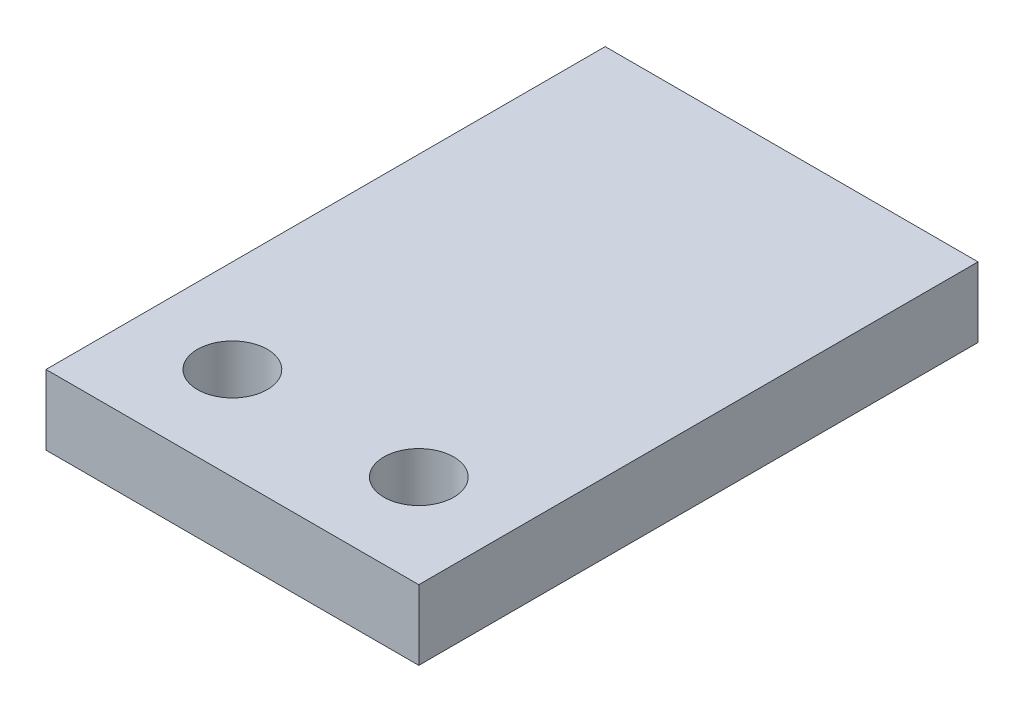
from build123d import *

# Parameters (mm, degrees)
SKETCH1_W          = 101.6
SKETCH1_H          = 152.4
SKETCH1_R          = 9.525
BASE_EXTRUDE_DEPTH = 19.05


with BuildPart() as part:
    # Sketch1 → Base-Extrude (new body)
    with BuildSketch(Plane(origin=(0, 0, 0), x_dir=(1, 0, 0), z_dir=(0, 1, 0))):
        with Locations((50.8, 76.2)):
            Rectangle(SKETCH1_W, SKETCH1_H)
        with Locations(Location((76.2, 25.4, 0), (0, 0, 90))):
            Circle(SKETCH1_R, mode=Mode.SUBTRACT)
        with Locations(Location((25.4, 25.4, 0), (0, 0, 90))):
            Circle(SKETCH1_R, mode=Mode.SUBTRACT)
    extrude(amount=BASE_EXTRUDE_DEPTH)


solid = part.part
